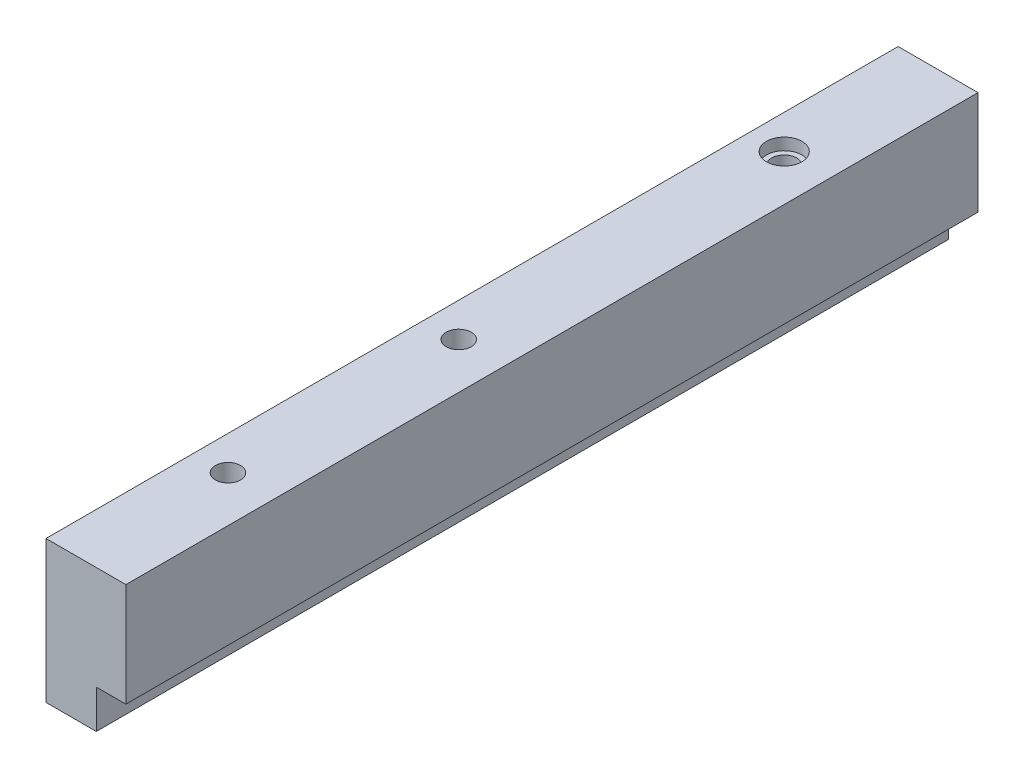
ISO-10303-21;
HEADER;
FILE_DESCRIPTION(('STEP AP214'),'2;1');
FILE_NAME('part.step','',(''),(''),'','','');
FILE_SCHEMA(('AUTOMOTIVE_DESIGN { 1 0 10303 214 1 1 1 1 }'));
ENDSEC;
DATA;
#1=APPLICATION_CONTEXT('core data for automotive mechanical design processes');
#2=APPLICATION_PROTOCOL_DEFINITION('international standard','automotive_design',2000,#1);
#3=PRODUCT_CONTEXT('',#1,'mechanical');
#4=PRODUCT('Part','Part','',(#3));
#5=PRODUCT_RELATED_PRODUCT_CATEGORY('part','',(#4));
#6=PRODUCT_DEFINITION_FORMATION('','',#4);
#7=PRODUCT_DEFINITION_CONTEXT('part definition',#1,'design');
#8=PRODUCT_DEFINITION('design','',#6,#7);
#9=PRODUCT_DEFINITION_SHAPE('','',#8);
#10=(LENGTH_UNIT() NAMED_UNIT(*) SI_UNIT(.MILLI.,.METRE.));
#11=(NAMED_UNIT(*) PLANE_ANGLE_UNIT() SI_UNIT($,.RADIAN.));
#12=(NAMED_UNIT(*) SI_UNIT($,.STERADIAN.) SOLID_ANGLE_UNIT());
#13=UNCERTAINTY_MEASURE_WITH_UNIT(LENGTH_MEASURE(1.E-05),#10,'distance_accuracy_value','');
#14=(GEOMETRIC_REPRESENTATION_CONTEXT(3) GLOBAL_UNCERTAINTY_ASSIGNED_CONTEXT((#13)) GLOBAL_UNIT_ASSIGNED_CONTEXT((#10,
#11,#12)) REPRESENTATION_CONTEXT('',''));
#15=CARTESIAN_POINT('',(0.,0.,0.));
#16=DIRECTION('',(0.,0.,1.));
#17=DIRECTION('',(1.,0.,0.));
#18=AXIS2_PLACEMENT_3D('',#15,#16,#17);
#19=CARTESIAN_POINT('',(122.2375,-79.3749999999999,228.6));
#20=DIRECTION('',(0.,-1.,0.));
#21=DIRECTION('',(1.,0.,0.));
#22=AXIS2_PLACEMENT_3D('',#19,#20,#21);
#23=PLANE('',#22);
#24=CARTESIAN_POINT('',(113.50625,-79.3749999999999,212.725));
#25=DIRECTION('',(0.,-1.,0.));
#26=DIRECTION('',(0.,0.,-1.));
#27=AXIS2_PLACEMENT_3D('',#24,#25,#26);
#28=CIRCLE('',#27,5.3467);
#29=CARTESIAN_POINT('',(113.50625,-79.3749999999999,207.3783));
#30=VERTEX_POINT('',#29);
#31=EDGE_CURVE('E173',#30,#30,#28,.T.);
#32=ORIENTED_EDGE('',*,*,#31,.F.);
#33=EDGE_LOOP('',(#32));
#34=FACE_BOUND('',#33,.T.);
#35=CARTESIAN_POINT('',(113.50625,-79.3749999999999,-212.725));
#36=DIRECTION('',(0.,-1.,0.));
#37=DIRECTION('',(0.,0.,-1.));
#38=AXIS2_PLACEMENT_3D('',#35,#36,#37);
#39=CIRCLE('',#38,5.3467);
#40=CARTESIAN_POINT('',(113.50625,-79.3749999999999,-218.0717));
#41=VERTEX_POINT('',#40);
#42=EDGE_CURVE('E186',#41,#41,#39,.T.);
#43=ORIENTED_EDGE('',*,*,#42,.F.);
#44=EDGE_LOOP('',(#43));
#45=FACE_BOUND('',#44,.T.);
#46=CARTESIAN_POINT('',(113.50625,-79.3750000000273,25.4));
#47=DIRECTION('',(0.,-1.,0.));
#48=DIRECTION('',(1.,0.,0.));
#49=AXIS2_PLACEMENT_3D('',#46,#47,#48);
#50=CIRCLE('',#49,6.74687500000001);
#51=CARTESIAN_POINT('',(120.253125,-79.3750000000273,25.4));
#52=VERTEX_POINT('',#51);
#53=EDGE_CURVE('E192',#52,#52,#50,.T.);
#54=ORIENTED_EDGE('',*,*,#53,.F.);
#55=EDGE_LOOP('',(#54));
#56=FACE_BOUND('',#55,.T.);
#57=CARTESIAN_POINT('',(113.50625,-79.3750000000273,149.225));
#58=DIRECTION('',(0.,-1.,0.));
#59=DIRECTION('',(1.,0.,0.));
#60=AXIS2_PLACEMENT_3D('',#57,#58,#59);
#61=CIRCLE('',#60,6.74687499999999);
#62=CARTESIAN_POINT('',(120.253125,-79.3750000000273,149.225));
#63=VERTEX_POINT('',#62);
#64=EDGE_CURVE('E196',#63,#63,#61,.T.);
#65=ORIENTED_EDGE('',*,*,#64,.F.);
#66=EDGE_LOOP('',(#65));
#67=FACE_BOUND('',#66,.T.);
#68=CARTESIAN_POINT('',(113.50625,-79.3749999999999,-149.225));
#69=DIRECTION('',(0.,-1.,0.));
#70=DIRECTION('',(1.,0.,0.));
#71=AXIS2_PLACEMENT_3D('',#68,#69,#70);
#72=CIRCLE('',#71,6.7437);
#73=CARTESIAN_POINT('',(120.24995,-79.3749999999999,-149.225));
#74=VERTEX_POINT('',#73);
#75=EDGE_CURVE('E132',#74,#74,#72,.T.);
#76=ORIENTED_EDGE('',*,*,#75,.F.);
#77=EDGE_LOOP('',(#76));
#78=FACE_BOUND('',#77,.T.);
#79=DIRECTION('',(-1.,0.,0.));
#80=VECTOR('',#79,1.);
#81=CARTESIAN_POINT('',(122.2375,-79.3749999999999,-228.6));
#82=LINE('',#81,#80);
#83=CARTESIAN_POINT('',(122.2375,-79.3749999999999,-228.6));
#84=VERTEX_POINT('',#83);
#85=CARTESIAN_POINT('',(95.25,-79.3749999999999,-228.6));
#86=VERTEX_POINT('',#85);
#87=EDGE_CURVE('E139',#84,#86,#82,.T.);
#88=ORIENTED_EDGE('',*,*,#87,.F.);
#89=DIRECTION('',(0.,0.,-1.));
#90=VECTOR('',#89,1.);
#91=CARTESIAN_POINT('',(122.2375,-79.3749999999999,228.6));
#92=LINE('',#91,#90);
#93=CARTESIAN_POINT('',(122.2375,-79.3749999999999,228.6));
#94=VERTEX_POINT('',#93);
#95=EDGE_CURVE('E57',#94,#84,#92,.T.);
#96=ORIENTED_EDGE('',*,*,#95,.F.);
#97=DIRECTION('',(-1.,0.,0.));
#98=VECTOR('',#97,1.);
#99=CARTESIAN_POINT('',(122.2375,-79.3749999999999,228.6));
#100=LINE('',#99,#98);
#101=CARTESIAN_POINT('',(95.25,-79.3749999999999,228.6));
#102=VERTEX_POINT('',#101);
#103=EDGE_CURVE('E124',#94,#102,#100,.T.);
#104=ORIENTED_EDGE('',*,*,#103,.T.);
#105=DIRECTION('',(0.,0.,-1.));
#106=VECTOR('',#105,1.);
#107=CARTESIAN_POINT('',(95.25,-79.3749999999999,228.6));
#108=LINE('',#107,#106);
#109=EDGE_CURVE('E79',#102,#86,#108,.T.);
#110=ORIENTED_EDGE('',*,*,#109,.T.);
#111=EDGE_LOOP('',(#88,#96,#104,#110));
#112=FACE_BOUND('',#111,.T.);
#113=CARTESIAN_POINT('',(113.50625,-79.3749999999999,-180.975));
#114=DIRECTION('',(0.,-1.,0.));
#115=DIRECTION('',(0.,0.,-1.));
#116=AXIS2_PLACEMENT_3D('',#113,#114,#115);
#117=CIRCLE('',#116,6.54049433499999);
#118=CARTESIAN_POINT('',(113.50625,-79.3749999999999,-187.515494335));
#119=VERTEX_POINT('',#118);
#120=EDGE_CURVE('E160',#119,#119,#117,.T.);
#121=ORIENTED_EDGE('',*,*,#120,.F.);
#122=EDGE_LOOP('',(#121));
#123=FACE_BOUND('',#122,.T.);
#124=CARTESIAN_POINT('',(113.50625,-79.3749999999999,180.975));
#125=DIRECTION('',(0.,-1.,0.));
#126=DIRECTION('',(0.,0.,-1.));
#127=AXIS2_PLACEMENT_3D('',#124,#125,#126);
#128=CIRCLE('',#127,6.54049433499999);
#129=CARTESIAN_POINT('',(113.50625,-79.3749999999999,174.434505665));
#130=VERTEX_POINT('',#129);
#131=EDGE_CURVE('E163',#130,#130,#128,.T.);
#132=ORIENTED_EDGE('',*,*,#131,.F.);
#133=EDGE_LOOP('',(#132));
#134=FACE_BOUND('',#133,.T.);
#135=ADVANCED_FACE('F39',(#34,#45,#56,#67,#78,#112,#123,#134),#23,.T.);
#136=CARTESIAN_POINT('',(113.50625,-3.17499999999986,-149.225));
#137=DIRECTION('',(0.,-1.,0.));
#138=DIRECTION('',(1.,0.,0.));
#139=AXIS2_PLACEMENT_3D('',#136,#137,#138);
#140=CYLINDRICAL_SURFACE('',#139,6.7437);
#141=CARTESIAN_POINT('',(113.50625,-9.52499999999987,-149.225));
#142=DIRECTION('',(0.,1.,0.));
#143=DIRECTION('',(-1.,0.,0.));
#144=AXIS2_PLACEMENT_3D('',#141,#142,#143);
#145=CIRCLE('',#144,6.7437);
#146=CARTESIAN_POINT('',(120.24995,-9.52499999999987,-149.225));
#147=VERTEX_POINT('',#146);
#148=EDGE_CURVE('E43',#147,#147,#145,.F.);
#149=CARTESIAN_POINT('',(120.24995,-79.3749999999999,-149.225));
#150=CARTESIAN_POINT('',(120.24995,-78.6473958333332,-149.225));
#151=CARTESIAN_POINT('',(120.24995,-77.9197916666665,-149.225));
#152=CARTESIAN_POINT('',(120.24995,-76.4645833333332,-149.225));
#153=CARTESIAN_POINT('',(120.24995,-75.7369791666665,-149.225));
#154=CARTESIAN_POINT('',(120.24995,-74.2817708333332,-149.225));
#155=CARTESIAN_POINT('',(120.24995,-73.5541666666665,-149.225));
#156=CARTESIAN_POINT('',(120.24995,-72.0989583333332,-149.225));
#157=CARTESIAN_POINT('',(120.24995,-71.3713541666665,-149.225));
#158=CARTESIAN_POINT('',(120.24995,-69.9161458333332,-149.225));
#159=CARTESIAN_POINT('',(120.24995,-69.1885416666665,-149.225));
#160=CARTESIAN_POINT('',(120.24995,-67.7333333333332,-149.225));
#161=CARTESIAN_POINT('',(120.24995,-67.0057291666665,-149.225));
#162=CARTESIAN_POINT('',(120.24995,-65.5505208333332,-149.225));
#163=CARTESIAN_POINT('',(120.24995,-64.8229166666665,-149.225));
#164=CARTESIAN_POINT('',(120.24995,-63.3677083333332,-149.225));
#165=CARTESIAN_POINT('',(120.24995,-62.6401041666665,-149.225));
#166=CARTESIAN_POINT('',(120.24995,-61.1848958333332,-149.225));
#167=CARTESIAN_POINT('',(120.24995,-60.4572916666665,-149.225));
#168=CARTESIAN_POINT('',(120.24995,-59.0020833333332,-149.225));
#169=CARTESIAN_POINT('',(120.24995,-58.2744791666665,-149.225));
#170=CARTESIAN_POINT('',(120.24995,-56.8192708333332,-149.225));
#171=CARTESIAN_POINT('',(120.24995,-56.0916666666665,-149.225));
#172=CARTESIAN_POINT('',(120.24995,-54.6364583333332,-149.225));
#173=CARTESIAN_POINT('',(120.24995,-53.9088541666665,-149.225));
#174=CARTESIAN_POINT('',(120.24995,-52.4536458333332,-149.225));
#175=CARTESIAN_POINT('',(120.24995,-51.7260416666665,-149.225));
#176=CARTESIAN_POINT('',(120.24995,-50.2708333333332,-149.225));
#177=CARTESIAN_POINT('',(120.24995,-49.5432291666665,-149.225));
#178=CARTESIAN_POINT('',(120.24995,-48.0880208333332,-149.225));
#179=CARTESIAN_POINT('',(120.24995,-47.3604166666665,-149.225));
#180=CARTESIAN_POINT('',(120.24995,-45.9052083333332,-149.225));
#181=CARTESIAN_POINT('',(120.24995,-45.1776041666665,-149.225));
#182=CARTESIAN_POINT('',(120.24995,-43.7223958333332,-149.225));
#183=CARTESIAN_POINT('',(120.24995,-42.9947916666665,-149.225));
#184=CARTESIAN_POINT('',(120.24995,-41.5395833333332,-149.225));
#185=CARTESIAN_POINT('',(120.24995,-40.8119791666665,-149.225));
#186=CARTESIAN_POINT('',(120.24995,-39.3567708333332,-149.225));
#187=CARTESIAN_POINT('',(120.24995,-38.6291666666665,-149.225));
#188=CARTESIAN_POINT('',(120.24995,-37.1739583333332,-149.225));
#189=CARTESIAN_POINT('',(120.24995,-36.4463541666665,-149.225));
#190=CARTESIAN_POINT('',(120.24995,-34.9911458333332,-149.225));
#191=CARTESIAN_POINT('',(120.24995,-34.2635416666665,-149.225));
#192=CARTESIAN_POINT('',(120.24995,-32.8083333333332,-149.225));
#193=CARTESIAN_POINT('',(120.24995,-32.0807291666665,-149.225));
#194=CARTESIAN_POINT('',(120.24995,-30.6255208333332,-149.225));
#195=CARTESIAN_POINT('',(120.24995,-29.8979166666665,-149.225));
#196=CARTESIAN_POINT('',(120.24995,-28.4427083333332,-149.225));
#197=CARTESIAN_POINT('',(120.24995,-27.7151041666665,-149.225));
#198=CARTESIAN_POINT('',(120.24995,-26.2598958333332,-149.225));
#199=CARTESIAN_POINT('',(120.24995,-25.5322916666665,-149.225));
#200=CARTESIAN_POINT('',(120.24995,-24.0770833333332,-149.225));
#201=CARTESIAN_POINT('',(120.24995,-23.3494791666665,-149.225));
#202=CARTESIAN_POINT('',(120.24995,-21.8942708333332,-149.225));
#203=CARTESIAN_POINT('',(120.24995,-21.1666666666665,-149.225));
#204=CARTESIAN_POINT('',(120.24995,-19.7114583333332,-149.225));
#205=CARTESIAN_POINT('',(120.24995,-18.9838541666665,-149.225));
#206=CARTESIAN_POINT('',(120.24995,-17.5286458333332,-149.225));
#207=CARTESIAN_POINT('',(120.24995,-16.8010416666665,-149.225));
#208=CARTESIAN_POINT('',(120.24995,-15.3458333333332,-149.225));
#209=CARTESIAN_POINT('',(120.24995,-14.6182291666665,-149.225));
#210=CARTESIAN_POINT('',(120.24995,-13.1630208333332,-149.225));
#211=CARTESIAN_POINT('',(120.24995,-12.4354166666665,-149.225));
#212=CARTESIAN_POINT('',(120.24995,-10.9802083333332,-149.225));
#213=CARTESIAN_POINT('',(120.24995,-10.2526041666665,-149.225));
#214=CARTESIAN_POINT('',(120.24995,-9.52499999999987,-149.225));
#215=B_SPLINE_CURVE_WITH_KNOTS('',3,(#149,#150,#151,#152,#153,#154,#155,#156,#157,#158,#159,
#160,#161,#162,#163,#164,#165,#166,#167,#168,#169,#170,#171,#172,#173,#174,#175,#176,#177,#178,
#179,#180,#181,#182,#183,#184,#185,#186,#187,#188,#189,#190,#191,#192,#193,#194,#195,#196,#197,
#198,#199,#200,#201,#202,#203,#204,#205,#206,#207,#208,#209,#210,#211,#212,#213,#214),
.UNSPECIFIED.,.F.,.F.,(4,2,2,2,2,2,2,2,2,2,2,2,2,2,2,2,2,2,2,2,2,2,2,2,2,2,2,2,2,2,2,2,4),(0.,
2.18281250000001,4.365625,6.5484375,8.73125,10.9140625,13.096875,15.2796875,17.4625,19.6453125,
21.828125,24.0109375,26.19375,28.3765625,30.559375,32.7421875,34.925,37.1078125,39.290625,
41.4734375,43.65625,45.8390625,48.021875,50.2046875,52.3875,54.5703125,56.753125,58.9359375,
61.11875,63.3015625,65.484375,67.6671875,69.85),.UNSPECIFIED.);
#216=EDGE_CURVE('BSEAM154',#74,#147,#215,.T.);
#217=ORIENTED_EDGE('',*,*,#75,.T.);
#218=ORIENTED_EDGE('',*,*,#148,.F.);
#219=ORIENTED_EDGE('',*,*,#216,.T.);
#220=ORIENTED_EDGE('',*,*,#216,.F.);
#221=EDGE_LOOP('',(#217,#219,#218,#220));
#222=FACE_BOUND('',#221,.T.);
#223=ADVANCED_FACE('F154',(#222),#140,.F.);
#224=CARTESIAN_POINT('',(122.2375,-79.3749999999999,228.6));
#225=DIRECTION('',(-1.,0.,0.));
#226=DIRECTION('',(0.,0.,1.));
#227=AXIS2_PLACEMENT_3D('',#224,#225,#226);
#228=PLANE('',#227);
#229=DIRECTION('',(0.,1.,0.));
#230=VECTOR('',#229,1.);
#231=CARTESIAN_POINT('',(122.2375,-79.3749999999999,-228.6));
#232=LINE('',#231,#230);
#233=CARTESIAN_POINT('',(122.2375,-58.7374999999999,-228.6));
#234=VERTEX_POINT('',#233);
#235=EDGE_CURVE('E129',#84,#234,#232,.T.);
#236=ORIENTED_EDGE('',*,*,#235,.T.);
#237=DIRECTION('',(0.,0.,-1.));
#238=VECTOR('',#237,1.);
#239=CARTESIAN_POINT('',(122.2375,-58.7374999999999,228.6));
#240=LINE('',#239,#238);
#241=CARTESIAN_POINT('',(122.2375,-58.7374999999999,228.6));
#242=VERTEX_POINT('',#241);
#243=EDGE_CURVE('E11',#242,#234,#240,.T.);
#244=ORIENTED_EDGE('',*,*,#243,.F.);
#245=DIRECTION('',(0.,1.,0.));
#246=VECTOR('',#245,1.);
#247=CARTESIAN_POINT('',(122.2375,-79.3749999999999,228.6));
#248=LINE('',#247,#246);
#249=EDGE_CURVE('E142',#94,#242,#248,.T.);
#250=ORIENTED_EDGE('',*,*,#249,.F.);
#251=ORIENTED_EDGE('',*,*,#95,.T.);
#252=EDGE_LOOP('',(#236,#244,#250,#251));
#253=FACE_BOUND('',#252,.T.);
#254=ADVANCED_FACE('F41',(#253),#228,.F.);
#255=CARTESIAN_POINT('',(122.2375,-58.7374999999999,228.6));
#256=DIRECTION('',(0.,1.,0.));
#257=DIRECTION('',(0.,0.,1.));
#258=AXIS2_PLACEMENT_3D('',#255,#256,#257);
#259=PLANE('',#258);
#260=DIRECTION('',(1.,0.,0.));
#261=VECTOR('',#260,1.);
#262=CARTESIAN_POINT('',(122.2375,-58.7374999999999,-228.6));
#263=LINE('',#262,#261);
#264=CARTESIAN_POINT('',(138.1125,-58.7374999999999,-228.6));
#265=VERTEX_POINT('',#264);
#266=EDGE_CURVE('E131',#234,#265,#263,.T.);
#267=ORIENTED_EDGE('',*,*,#266,.T.);
#268=DIRECTION('',(0.,0.,-1.));
#269=VECTOR('',#268,1.);
#270=CARTESIAN_POINT('',(138.1125,-58.7374999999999,228.6));
#271=LINE('',#270,#269);
#272=CARTESIAN_POINT('',(138.1125,-58.7374999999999,228.6));
#273=VERTEX_POINT('',#272);
#274=EDGE_CURVE('E49',#273,#265,#271,.T.);
#275=ORIENTED_EDGE('',*,*,#274,.F.);
#276=DIRECTION('',(1.,0.,0.));
#277=VECTOR('',#276,1.);
#278=CARTESIAN_POINT('',(122.2375,-58.7374999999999,228.6));
#279=LINE('',#278,#277);
#280=EDGE_CURVE('E91',#242,#273,#279,.T.);
#281=ORIENTED_EDGE('',*,*,#280,.F.);
#282=ORIENTED_EDGE('',*,*,#243,.T.);
#283=EDGE_LOOP('',(#267,#275,#281,#282));
#284=FACE_BOUND('',#283,.T.);
#285=ADVANCED_FACE('F214',(#284),#259,.F.);
#286=CARTESIAN_POINT('',(138.1125,-58.7374999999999,228.6));
#287=DIRECTION('',(-1.,0.,0.));
#288=DIRECTION('',(0.,0.,1.));
#289=AXIS2_PLACEMENT_3D('',#286,#287,#288);
#290=PLANE('',#289);
#291=DIRECTION('',(0.,1.,0.));
#292=VECTOR('',#291,1.);
#293=CARTESIAN_POINT('',(138.1125,-58.7374999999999,-228.6));
#294=LINE('',#293,#292);
#295=CARTESIAN_POINT('',(138.1125,-3.17499999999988,-228.6));
#296=VERTEX_POINT('',#295);
#297=EDGE_CURVE('E134',#265,#296,#294,.T.);
#298=ORIENTED_EDGE('',*,*,#297,.T.);
#299=DIRECTION('',(0.,0.,-1.));
#300=VECTOR('',#299,1.);
#301=CARTESIAN_POINT('',(138.1125,-3.17499999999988,228.6));
#302=LINE('',#301,#300);
#303=CARTESIAN_POINT('',(138.1125,-3.17499999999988,228.6));
#304=VERTEX_POINT('',#303);
#305=EDGE_CURVE('E121',#304,#296,#302,.T.);
#306=ORIENTED_EDGE('',*,*,#305,.F.);
#307=DIRECTION('',(0.,1.,0.));
#308=VECTOR('',#307,1.);
#309=CARTESIAN_POINT('',(138.1125,-58.7374999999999,228.6));
#310=LINE('',#309,#308);
#311=EDGE_CURVE('E109',#273,#304,#310,.T.);
#312=ORIENTED_EDGE('',*,*,#311,.F.);
#313=ORIENTED_EDGE('',*,*,#274,.T.);
#314=EDGE_LOOP('',(#298,#306,#312,#313));
#315=FACE_BOUND('',#314,.T.);
#316=ADVANCED_FACE('F149',(#315),#290,.F.);
#317=CARTESIAN_POINT('',(138.1125,-3.17499999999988,228.6));
#318=DIRECTION('',(0.,-1.,0.));
#319=DIRECTION('',(1.,0.,0.));
#320=AXIS2_PLACEMENT_3D('',#317,#318,#319);
#321=PLANE('',#320);
#322=CARTESIAN_POINT('',(113.50625,-3.17499999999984,25.4));
#323=DIRECTION('',(0.,-1.,0.));
#324=DIRECTION('',(1.,0.,0.));
#325=AXIS2_PLACEMENT_3D('',#322,#323,#324);
#326=CIRCLE('',#325,6.74687500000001);
#327=CARTESIAN_POINT('',(120.253125,-3.17499999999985,25.4));
#328=VERTEX_POINT('',#327);
#329=EDGE_CURVE('E193',#328,#328,#326,.T.);
#330=ORIENTED_EDGE('',*,*,#329,.T.);
#331=EDGE_LOOP('',(#330));
#332=FACE_BOUND('',#331,.T.);
#333=CARTESIAN_POINT('',(113.50625,-3.17499999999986,149.225));
#334=DIRECTION('',(0.,-1.,0.));
#335=DIRECTION('',(1.,0.,0.));
#336=AXIS2_PLACEMENT_3D('',#333,#334,#335);
#337=CIRCLE('',#336,6.74687499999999);
#338=CARTESIAN_POINT('',(120.253125,-3.17499999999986,149.225));
#339=VERTEX_POINT('',#338);
#340=EDGE_CURVE('E199',#339,#339,#337,.T.);
#341=ORIENTED_EDGE('',*,*,#340,.T.);
#342=EDGE_LOOP('',(#341));
#343=FACE_BOUND('',#342,.T.);
#344=CARTESIAN_POINT('',(113.50625,-3.17499999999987,-149.225));
#345=DIRECTION('',(0.,1.,0.));
#346=DIRECTION('',(-1.,0.,0.));
#347=AXIS2_PLACEMENT_3D('',#344,#345,#346);
#348=CIRCLE('',#347,9.52499999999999);
#349=CARTESIAN_POINT('',(103.98125,-3.17499999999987,-149.225));
#350=VERTEX_POINT('',#349);
#351=EDGE_CURVE('E202',#350,#350,#348,.T.);
#352=ORIENTED_EDGE('',*,*,#351,.F.);
#353=EDGE_LOOP('',(#352));
#354=FACE_BOUND('',#353,.T.);
#355=DIRECTION('',(-1.,0.,0.));
#356=VECTOR('',#355,1.);
#357=CARTESIAN_POINT('',(138.1125,-3.17499999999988,-228.6));
#358=LINE('',#357,#356);
#359=CARTESIAN_POINT('',(95.25,-3.17499999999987,-228.6));
#360=VERTEX_POINT('',#359);
#361=EDGE_CURVE('E118',#296,#360,#358,.T.);
#362=ORIENTED_EDGE('',*,*,#361,.T.);
#363=DIRECTION('',(0.,0.,-1.));
#364=VECTOR('',#363,1.);
#365=CARTESIAN_POINT('',(95.25,-3.17499999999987,228.6));
#366=LINE('',#365,#364);
#367=CARTESIAN_POINT('',(95.25,-3.17499999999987,228.6));
#368=VERTEX_POINT('',#367);
#369=EDGE_CURVE('E115',#368,#360,#366,.T.);
#370=ORIENTED_EDGE('',*,*,#369,.F.);
#371=DIRECTION('',(-1.,0.,0.));
#372=VECTOR('',#371,1.);
#373=CARTESIAN_POINT('',(138.1125,-3.17499999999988,228.6));
#374=LINE('',#373,#372);
#375=EDGE_CURVE('E102',#304,#368,#374,.T.);
#376=ORIENTED_EDGE('',*,*,#375,.F.);
#377=ORIENTED_EDGE('',*,*,#305,.T.);
#378=EDGE_LOOP('',(#362,#370,#376,#377));
#379=FACE_BOUND('',#378,.T.);
#380=ADVANCED_FACE('F116',(#332,#343,#354,#379),#321,.F.);
#381=CARTESIAN_POINT('',(95.25,-3.17499999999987,228.6));
#382=DIRECTION('',(1.,0.,0.));
#383=DIRECTION('',(0.,0.,-1.));
#384=AXIS2_PLACEMENT_3D('',#381,#382,#383);
#385=PLANE('',#384);
#386=DIRECTION('',(0.,-1.,0.));
#387=VECTOR('',#386,1.);
#388=CARTESIAN_POINT('',(95.25,-3.17499999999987,-228.6));
#389=LINE('',#388,#387);
#390=EDGE_CURVE('E137',#360,#86,#389,.T.);
#391=ORIENTED_EDGE('',*,*,#390,.T.);
#392=ORIENTED_EDGE('',*,*,#109,.F.);
#393=DIRECTION('',(0.,-1.,0.));
#394=VECTOR('',#393,1.);
#395=CARTESIAN_POINT('',(95.25,-3.17499999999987,228.6));
#396=LINE('',#395,#394);
#397=EDGE_CURVE('E107',#368,#102,#396,.T.);
#398=ORIENTED_EDGE('',*,*,#397,.F.);
#399=ORIENTED_EDGE('',*,*,#369,.T.);
#400=EDGE_LOOP('',(#391,#392,#398,#399));
#401=FACE_BOUND('',#400,.T.);
#402=ADVANCED_FACE('F123',(#401),#385,.F.);
#403=CARTESIAN_POINT('',(122.2375,-58.7374999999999,228.6));
#404=DIRECTION('',(0.,0.,-1.));
#405=DIRECTION('',(-1.,0.,0.));
#406=AXIS2_PLACEMENT_3D('',#403,#404,#405);
#407=PLANE('',#406);
#408=ORIENTED_EDGE('',*,*,#249,.T.);
#409=ORIENTED_EDGE('',*,*,#280,.T.);
#410=ORIENTED_EDGE('',*,*,#311,.T.);
#411=ORIENTED_EDGE('',*,*,#375,.T.);
#412=ORIENTED_EDGE('',*,*,#397,.T.);
#413=ORIENTED_EDGE('',*,*,#103,.F.);
#414=EDGE_LOOP('',(#408,#409,#410,#411,#412,#413));
#415=FACE_BOUND('',#414,.T.);
#416=ADVANCED_FACE('F104',(#415),#407,.F.);
#417=CARTESIAN_POINT('',(122.2375,-58.7374999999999,-228.6));
#418=DIRECTION('',(0.,0.,-1.));
#419=DIRECTION('',(-1.,0.,0.));
#420=AXIS2_PLACEMENT_3D('',#417,#418,#419);
#421=PLANE('',#420);
#422=ORIENTED_EDGE('',*,*,#235,.F.);
#423=ORIENTED_EDGE('',*,*,#87,.T.);
#424=ORIENTED_EDGE('',*,*,#390,.F.);
#425=ORIENTED_EDGE('',*,*,#361,.F.);
#426=ORIENTED_EDGE('',*,*,#297,.F.);
#427=ORIENTED_EDGE('',*,*,#266,.F.);
#428=EDGE_LOOP('',(#422,#423,#424,#425,#426,#427));
#429=FACE_BOUND('',#428,.T.);
#430=ADVANCED_FACE('F151',(#429),#421,.T.);
#431=CARTESIAN_POINT('',(113.50625,-9.52499999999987,-149.225));
#432=DIRECTION('',(0.,1.,0.));
#433=DIRECTION('',(-1.,0.,0.));
#434=AXIS2_PLACEMENT_3D('',#431,#432,#433);
#435=PLANE('',#434);
#436=CARTESIAN_POINT('',(113.50625,-9.52499999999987,-149.225));
#437=DIRECTION('',(0.,1.,0.));
#438=DIRECTION('',(-1.,0.,0.));
#439=AXIS2_PLACEMENT_3D('',#436,#437,#438);
#440=CIRCLE('',#439,9.52499999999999);
#441=CARTESIAN_POINT('',(103.98125,-9.52499999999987,-149.225));
#442=VERTEX_POINT('',#441);
#443=EDGE_CURVE('E205',#442,#442,#440,.T.);
#444=ORIENTED_EDGE('',*,*,#443,.T.);
#445=EDGE_LOOP('',(#444));
#446=FACE_BOUND('',#445,.T.);
#447=ORIENTED_EDGE('',*,*,#148,.T.);
#448=EDGE_LOOP('',(#447));
#449=FACE_BOUND('',#448,.T.);
#450=ADVANCED_FACE('F229',(#446,#449),#435,.T.);
#451=CARTESIAN_POINT('',(113.50625,-9.52499999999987,-149.225));
#452=DIRECTION('',(0.,1.,0.));
#453=DIRECTION('',(-1.,0.,0.));
#454=AXIS2_PLACEMENT_3D('',#451,#452,#453);
#455=CYLINDRICAL_SURFACE('',#454,9.52499999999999);
#456=ORIENTED_EDGE('',*,*,#443,.F.);
#457=EDGE_LOOP('',(#456));
#458=FACE_BOUND('',#457,.T.);
#459=ORIENTED_EDGE('',*,*,#351,.T.);
#460=EDGE_LOOP('',(#459));
#461=FACE_BOUND('',#460,.T.);
#462=ADVANCED_FACE('F235',(#458,#461),#455,.F.);
#463=CARTESIAN_POINT('',(113.50625,-3.17499999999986,149.225));
#464=DIRECTION('',(0.,-1.,0.));
#465=DIRECTION('',(1.,0.,0.));
#466=AXIS2_PLACEMENT_3D('',#463,#464,#465);
#467=CYLINDRICAL_SURFACE('',#466,6.74687499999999);
#468=ORIENTED_EDGE('',*,*,#340,.F.);
#469=EDGE_LOOP('',(#468));
#470=FACE_BOUND('',#469,.T.);
#471=ORIENTED_EDGE('',*,*,#64,.T.);
#472=EDGE_LOOP('',(#471));
#473=FACE_BOUND('',#472,.T.);
#474=ADVANCED_FACE('F238',(#470,#473),#467,.F.);
#475=CARTESIAN_POINT('',(113.50625,-3.17499999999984,25.4));
#476=DIRECTION('',(0.,-1.,0.));
#477=DIRECTION('',(1.,0.,0.));
#478=AXIS2_PLACEMENT_3D('',#475,#476,#477);
#479=CYLINDRICAL_SURFACE('',#478,6.74687500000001);
#480=ORIENTED_EDGE('',*,*,#329,.F.);
#481=EDGE_LOOP('',(#480));
#482=FACE_BOUND('',#481,.T.);
#483=ORIENTED_EDGE('',*,*,#53,.T.);
#484=EDGE_LOOP('',(#483));
#485=FACE_BOUND('',#484,.T.);
#486=ADVANCED_FACE('F245',(#482,#485),#479,.F.);
#487=CARTESIAN_POINT('',(113.50625,-52.3875233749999,-212.725));
#488=DIRECTION('',(0.,-1.,0.));
#489=DIRECTION('',(0.,0.,-1.));
#490=AXIS2_PLACEMENT_3D('',#487,#488,#489);
#491=CONICAL_SURFACE('',#490,0.,1.15126826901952);
#492=CARTESIAN_POINT('',(113.50625,-54.7721868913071,-212.725));
#493=DIRECTION('',(0.,-1.,0.));
#494=DIRECTION('',(0.,0.,-1.));
#495=AXIS2_PLACEMENT_3D('',#492,#493,#494);
#496=CIRCLE('',#495,5.3467);
#497=CARTESIAN_POINT('',(113.50625,-54.7721868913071,-218.0717));
#498=VERTEX_POINT('',#497);
#499=EDGE_CURVE('E189',#498,#498,#496,.T.);
#500=ORIENTED_EDGE('',*,*,#499,.T.);
#501=EDGE_LOOP('',(#500));
#502=FACE_BOUND('',#501,.T.);
#503=CARTESIAN_POINT('',(113.50625,-52.3875233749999,-212.725));
#504=VERTEX_POINT('',#503);
#505=VERTEX_LOOP('',#504);
#506=FACE_BOUND('',#505,.T.);
#507=ADVANCED_FACE('F249',(#502,#506),#491,.F.);
#508=CARTESIAN_POINT('',(113.50625,-79.3749999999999,-212.725));
#509=DIRECTION('',(0.,-1.,0.));
#510=DIRECTION('',(0.,0.,-1.));
#511=AXIS2_PLACEMENT_3D('',#508,#509,#510);
#512=CYLINDRICAL_SURFACE('',#511,5.3467);
#513=ORIENTED_EDGE('',*,*,#42,.T.);
#514=EDGE_LOOP('',(#513));
#515=FACE_BOUND('',#514,.T.);
#516=ORIENTED_EDGE('',*,*,#499,.F.);
#517=EDGE_LOOP('',(#516));
#518=FACE_BOUND('',#517,.T.);
#519=ADVANCED_FACE('F253',(#515,#518),#512,.F.);
#520=CARTESIAN_POINT('',(113.50625,-50.1595603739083,-180.975));
#521=DIRECTION('',(0.,-1.,0.));
#522=DIRECTION('',(0.,0.,-1.));
#523=AXIS2_PLACEMENT_3D('',#520,#521,#522);
#524=CONICAL_SURFACE('',#523,0.,1.02974425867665);
#525=CARTESIAN_POINT('',(113.50625,-53.9750219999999,-180.975));
#526=DIRECTION('',(0.,-1.,0.));
#527=DIRECTION('',(0.,0.,-1.));
#528=AXIS2_PLACEMENT_3D('',#525,#526,#527);
#529=CIRCLE('',#528,6.3499945);
#530=CARTESIAN_POINT('',(113.50625,-53.9750219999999,-187.3249945));
#531=VERTEX_POINT('',#530);
#532=EDGE_CURVE('E183',#531,#531,#529,.T.);
#533=ORIENTED_EDGE('',*,*,#532,.T.);
#534=EDGE_LOOP('',(#533));
#535=FACE_BOUND('',#534,.T.);
#536=CARTESIAN_POINT('',(113.50625,-50.1595603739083,-180.975));
#537=VERTEX_POINT('',#536);
#538=VERTEX_LOOP('',#537);
#539=FACE_BOUND('',#538,.T.);
#540=ADVANCED_FACE('F257',(#535,#539),#524,.F.);
#541=CARTESIAN_POINT('',(113.50625,-79.3749999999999,-180.975));
#542=DIRECTION('',(0.,-1.,0.));
#543=DIRECTION('',(0.,0.,-1.));
#544=AXIS2_PLACEMENT_3D('',#541,#542,#543);
#545=CYLINDRICAL_SURFACE('',#544,6.34999449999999);
#546=CARTESIAN_POINT('',(113.50625,-79.1845001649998,-180.975));
#547=DIRECTION('',(0.,-1.,0.));
#548=DIRECTION('',(0.,0.,-1.));
#549=AXIS2_PLACEMENT_3D('',#546,#547,#548);
#550=CIRCLE('',#549,6.34999449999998);
#551=CARTESIAN_POINT('',(113.50625,-79.1845001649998,-187.3249945));
#552=VERTEX_POINT('',#551);
#553=EDGE_CURVE('E180',#552,#552,#550,.T.);
#554=ORIENTED_EDGE('',*,*,#553,.T.);
#555=EDGE_LOOP('',(#554));
#556=FACE_BOUND('',#555,.T.);
#557=ORIENTED_EDGE('',*,*,#532,.F.);
#558=EDGE_LOOP('',(#557));
#559=FACE_BOUND('',#558,.T.);
#560=ADVANCED_FACE('F261',(#556,#559),#545,.F.);
#561=CARTESIAN_POINT('',(113.50625,-79.1845001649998,-180.975));
#562=DIRECTION('',(0.,-1.,0.));
#563=DIRECTION('',(0.,0.,-1.));
#564=AXIS2_PLACEMENT_3D('',#561,#562,#563);
#565=CONICAL_SURFACE('',#564,6.34999449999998,0.785398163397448);
#566=ORIENTED_EDGE('',*,*,#120,.T.);
#567=EDGE_LOOP('',(#566));
#568=FACE_BOUND('',#567,.T.);
#569=ORIENTED_EDGE('',*,*,#553,.F.);
#570=EDGE_LOOP('',(#569));
#571=FACE_BOUND('',#570,.T.);
#572=ADVANCED_FACE('F265',(#568,#571),#565,.F.);
#573=CARTESIAN_POINT('',(113.50625,-52.3875233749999,212.725));
#574=DIRECTION('',(0.,-1.,0.));
#575=DIRECTION('',(0.,0.,-1.));
#576=AXIS2_PLACEMENT_3D('',#573,#574,#575);
#577=CONICAL_SURFACE('',#576,0.,1.15126826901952);
#578=CARTESIAN_POINT('',(113.50625,-54.7721868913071,212.725));
#579=DIRECTION('',(0.,-1.,0.));
#580=DIRECTION('',(0.,0.,-1.));
#581=AXIS2_PLACEMENT_3D('',#578,#579,#580);
#582=CIRCLE('',#581,5.3467);
#583=CARTESIAN_POINT('',(113.50625,-54.7721868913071,207.3783));
#584=VERTEX_POINT('',#583);
#585=EDGE_CURVE('E176',#584,#584,#582,.T.);
#586=ORIENTED_EDGE('',*,*,#585,.T.);
#587=EDGE_LOOP('',(#586));
#588=FACE_BOUND('',#587,.T.);
#589=CARTESIAN_POINT('',(113.50625,-52.3875233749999,212.725));
#590=VERTEX_POINT('',#589);
#591=VERTEX_LOOP('',#590);
#592=FACE_BOUND('',#591,.T.);
#593=ADVANCED_FACE('F269',(#588,#592),#577,.F.);
#594=CARTESIAN_POINT('',(113.50625,-79.3749999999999,212.725));
#595=DIRECTION('',(0.,-1.,0.));
#596=DIRECTION('',(0.,0.,-1.));
#597=AXIS2_PLACEMENT_3D('',#594,#595,#596);
#598=CYLINDRICAL_SURFACE('',#597,5.3467);
#599=ORIENTED_EDGE('',*,*,#31,.T.);
#600=EDGE_LOOP('',(#599));
#601=FACE_BOUND('',#600,.T.);
#602=ORIENTED_EDGE('',*,*,#585,.F.);
#603=EDGE_LOOP('',(#602));
#604=FACE_BOUND('',#603,.T.);
#605=ADVANCED_FACE('F273',(#601,#604),#598,.F.);
#606=CARTESIAN_POINT('',(113.50625,-50.1595603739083,180.975));
#607=DIRECTION('',(0.,-1.,0.));
#608=DIRECTION('',(0.,0.,-1.));
#609=AXIS2_PLACEMENT_3D('',#606,#607,#608);
#610=CONICAL_SURFACE('',#609,0.,1.02974425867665);
#611=CARTESIAN_POINT('',(113.50625,-53.9750219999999,180.975));
#612=DIRECTION('',(0.,-1.,0.));
#613=DIRECTION('',(0.,0.,-1.));
#614=AXIS2_PLACEMENT_3D('',#611,#612,#613);
#615=CIRCLE('',#614,6.3499945);
#616=CARTESIAN_POINT('',(113.50625,-53.9750219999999,174.6250055));
#617=VERTEX_POINT('',#616);
#618=EDGE_CURVE('E168',#617,#617,#615,.T.);
#619=ORIENTED_EDGE('',*,*,#618,.T.);
#620=EDGE_LOOP('',(#619));
#621=FACE_BOUND('',#620,.T.);
#622=CARTESIAN_POINT('',(113.50625,-50.1595603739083,180.975));
#623=VERTEX_POINT('',#622);
#624=VERTEX_LOOP('',#623);
#625=FACE_BOUND('',#624,.T.);
#626=ADVANCED_FACE('F277',(#621,#625),#610,.F.);
#627=CARTESIAN_POINT('',(113.50625,-79.3749999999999,180.975));
#628=DIRECTION('',(0.,-1.,0.));
#629=DIRECTION('',(0.,0.,-1.));
#630=AXIS2_PLACEMENT_3D('',#627,#628,#629);
#631=CYLINDRICAL_SURFACE('',#630,6.34999449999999);
#632=CARTESIAN_POINT('',(113.50625,-79.1845001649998,180.975));
#633=DIRECTION('',(0.,-1.,0.));
#634=DIRECTION('',(0.,0.,-1.));
#635=AXIS2_PLACEMENT_3D('',#632,#633,#634);
#636=CIRCLE('',#635,6.34999449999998);
#637=CARTESIAN_POINT('',(113.50625,-79.1845001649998,174.6250055));
#638=VERTEX_POINT('',#637);
#639=EDGE_CURVE('E165',#638,#638,#636,.T.);
#640=ORIENTED_EDGE('',*,*,#639,.T.);
#641=EDGE_LOOP('',(#640));
#642=FACE_BOUND('',#641,.T.);
#643=ORIENTED_EDGE('',*,*,#618,.F.);
#644=EDGE_LOOP('',(#643));
#645=FACE_BOUND('',#644,.T.);
#646=ADVANCED_FACE('F281',(#642,#645),#631,.F.);
#647=CARTESIAN_POINT('',(113.50625,-79.1845001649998,180.975));
#648=DIRECTION('',(0.,-1.,0.));
#649=DIRECTION('',(0.,0.,-1.));
#650=AXIS2_PLACEMENT_3D('',#647,#648,#649);
#651=CONICAL_SURFACE('',#650,6.34999449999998,0.785398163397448);
#652=ORIENTED_EDGE('',*,*,#131,.T.);
#653=EDGE_LOOP('',(#652));
#654=FACE_BOUND('',#653,.T.);
#655=ORIENTED_EDGE('',*,*,#639,.F.);
#656=EDGE_LOOP('',(#655));
#657=FACE_BOUND('',#656,.T.);
#658=ADVANCED_FACE('F285',(#654,#657),#651,.F.);
#659=CLOSED_SHELL('',(#135,#223,#254,#285,#316,#380,#402,#416,#430,#450,#462,#474,#486,#507,
#519,#540,#560,#572,#593,#605,#626,#646,#658));
#660=MANIFOLD_SOLID_BREP('B2',#659);
#661=ADVANCED_BREP_SHAPE_REPRESENTATION('',(#18,#660),#14);
#662=SHAPE_DEFINITION_REPRESENTATION(#9,#661);
ENDSEC;
END-ISO-10303-21;
